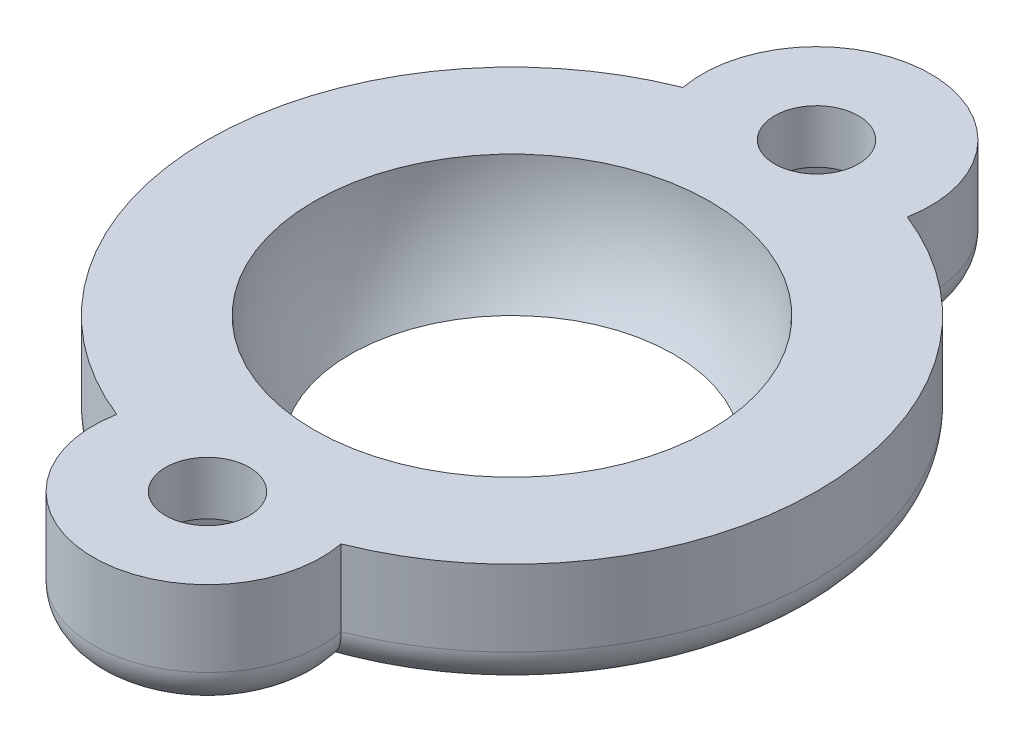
ISO-10303-21;
HEADER;
FILE_DESCRIPTION(('STEP AP214'),'2;1');
FILE_NAME('part.step','',(''),(''),'','','');
FILE_SCHEMA(('AUTOMOTIVE_DESIGN { 1 0 10303 214 1 1 1 1 }'));
ENDSEC;
DATA;
#1=APPLICATION_CONTEXT('core data for automotive mechanical design processes');
#2=APPLICATION_PROTOCOL_DEFINITION('international standard','automotive_design',2000,#1);
#3=PRODUCT_CONTEXT('',#1,'mechanical');
#4=PRODUCT('Part','Part','',(#3));
#5=PRODUCT_RELATED_PRODUCT_CATEGORY('part','',(#4));
#6=PRODUCT_DEFINITION_FORMATION('','',#4);
#7=PRODUCT_DEFINITION_CONTEXT('part definition',#1,'design');
#8=PRODUCT_DEFINITION('design','',#6,#7);
#9=PRODUCT_DEFINITION_SHAPE('','',#8);
#10=(LENGTH_UNIT() NAMED_UNIT(*) SI_UNIT(.MILLI.,.METRE.));
#11=(NAMED_UNIT(*) PLANE_ANGLE_UNIT() SI_UNIT($,.RADIAN.));
#12=(NAMED_UNIT(*) SI_UNIT($,.STERADIAN.) SOLID_ANGLE_UNIT());
#13=UNCERTAINTY_MEASURE_WITH_UNIT(LENGTH_MEASURE(1.E-05),#10,'distance_accuracy_value','');
#14=(GEOMETRIC_REPRESENTATION_CONTEXT(3) GLOBAL_UNCERTAINTY_ASSIGNED_CONTEXT((#13)) GLOBAL_UNIT_ASSIGNED_CONTEXT((#10,
#11,#12)) REPRESENTATION_CONTEXT('',''));
#15=CARTESIAN_POINT('',(0.,0.,0.));
#16=DIRECTION('',(0.,0.,1.));
#17=DIRECTION('',(1.,0.,0.));
#18=AXIS2_PLACEMENT_3D('',#15,#16,#17);
#19=CARTESIAN_POINT('',(-73.1998646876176,-6.5,-38.5));
#20=DIRECTION('',(0.,-1.,0.));
#21=DIRECTION('',(0.,0.,-1.));
#22=AXIS2_PLACEMENT_3D('',#19,#20,#21);
#23=PLANE('',#22);
#24=DIRECTION('',(0.500000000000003,0.,-0.866025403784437));
#25=VECTOR('',#24,1.);
#26=CARTESIAN_POINT('',(-75.3937957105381,-6.5,-42.5));
#27=LINE('',#26,#25);
#28=CARTESIAN_POINT('',(-75.1575628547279,-6.5,-42.9091673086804));
#29=VERTEX_POINT('',#28);
#30=CARTESIAN_POINT('',(-74.533063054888,-6.5,-43.9908326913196));
#31=VERTEX_POINT('',#30);
#32=EDGE_CURVE('E432',#29,#31,#27,.T.);
#33=ORIENTED_EDGE('',*,*,#32,.F.);
#34=CARTESIAN_POINT('',(-73.1998646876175,-6.5,-42.5));
#35=DIRECTION('',(0.,-1.,0.));
#36=DIRECTION('',(0.,0.,-1.));
#37=AXIS2_PLACEMENT_3D('',#34,#35,#36);
#38=CIRCLE('',#37,2.00000000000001);
#39=EDGE_CURVE('E287',#29,#31,#38,.T.);
#40=ORIENTED_EDGE('',*,*,#39,.T.);
#41=EDGE_LOOP('',(#33,#40));
#42=FACE_BOUND('',#41,.T.);
#43=ADVANCED_FACE('F37',(#42),#23,.T.);
#44=DIRECTION('',(1.,0.,0.));
#45=VECTOR('',#44,1.);
#46=CARTESIAN_POINT('',(-74.2968301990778,-6.5,-44.4));
#47=LINE('',#46,#45);
#48=CARTESIAN_POINT('',(-73.8243644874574,-6.5,-44.4));
#49=VERTEX_POINT('',#48);
#50=CARTESIAN_POINT('',(-72.5753648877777,-6.5,-44.4));
#51=VERTEX_POINT('',#50);
#52=EDGE_CURVE('E436',#49,#51,#47,.T.);
#53=ORIENTED_EDGE('',*,*,#52,.F.);
#54=CARTESIAN_POINT('',(-73.1998646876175,-6.5,-42.5));
#55=DIRECTION('',(0.,-1.,0.));
#56=DIRECTION('',(0.,0.,-1.));
#57=AXIS2_PLACEMENT_3D('',#54,#55,#56);
#58=CIRCLE('',#57,2.00000000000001);
#59=EDGE_CURVE('E285',#49,#51,#58,.T.);
#60=ORIENTED_EDGE('',*,*,#59,.T.);
#61=EDGE_LOOP('',(#53,#60));
#62=FACE_BOUND('',#61,.T.);
#63=ADVANCED_FACE('F423',(#62),#23,.T.);
#64=DIRECTION('',(0.5,0.,0.866025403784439));
#65=VECTOR('',#64,1.);
#66=CARTESIAN_POINT('',(-72.1028991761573,-6.5,-44.4));
#67=LINE('',#66,#65);
#68=CARTESIAN_POINT('',(-71.8666663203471,-6.5,-43.9908326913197));
#69=VERTEX_POINT('',#68);
#70=CARTESIAN_POINT('',(-71.2421665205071,-6.5,-42.9091673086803));
#71=VERTEX_POINT('',#70);
#72=EDGE_CURVE('E496',#69,#71,#67,.T.);
#73=ORIENTED_EDGE('',*,*,#72,.F.);
#74=CARTESIAN_POINT('',(-73.1998646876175,-6.5,-42.5));
#75=DIRECTION('',(0.,-1.,0.));
#76=DIRECTION('',(0.,0.,-1.));
#77=AXIS2_PLACEMENT_3D('',#74,#75,#76);
#78=CIRCLE('',#77,2.00000000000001);
#79=EDGE_CURVE('E283',#69,#71,#78,.T.);
#80=ORIENTED_EDGE('',*,*,#79,.T.);
#81=EDGE_LOOP('',(#73,#80));
#82=FACE_BOUND('',#81,.T.);
#83=ADVANCED_FACE('F428',(#82),#23,.T.);
#84=CARTESIAN_POINT('',(-73.1998646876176,-6.5,-34.5));
#85=DIRECTION('',(0.,-1.,0.));
#86=DIRECTION('',(0.,0.,-1.));
#87=AXIS2_PLACEMENT_3D('',#84,#85,#86);
#88=CIRCLE('',#87,4.24735211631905);
#89=CARTESIAN_POINT('',(-73.1998646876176,-6.5,-38.7473521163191));
#90=VERTEX_POINT('',#89);
#91=EDGE_CURVE('E252',#90,#90,#88,.F.);
#92=ORIENTED_EDGE('',*,*,#91,.T.);
#93=EDGE_LOOP('',(#92));
#94=FACE_BOUND('',#93,.T.);
#95=DIRECTION('',(-0.500000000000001,0.,0.866025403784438));
#96=VECTOR('',#95,1.);
#97=CARTESIAN_POINT('',(-71.005933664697,-6.5,-42.5));
#98=LINE('',#97,#96);
#99=CARTESIAN_POINT('',(-71.2421665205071,-6.5,-42.0908326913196));
#100=VERTEX_POINT('',#99);
#101=CARTESIAN_POINT('',(-72.1028991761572,-6.5,-40.6));
#102=VERTEX_POINT('',#101);
#103=EDGE_CURVE('E489',#100,#102,#98,.T.);
#104=ORIENTED_EDGE('',*,*,#103,.F.);
#105=CARTESIAN_POINT('',(-73.1998646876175,-6.5,-42.5));
#106=DIRECTION('',(0.,-1.,0.));
#107=DIRECTION('',(0.,0.,-1.));
#108=AXIS2_PLACEMENT_3D('',#105,#106,#107);
#109=CIRCLE('',#108,2.00000000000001);
#110=CARTESIAN_POINT('',(-71.5905655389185,-6.5,-41.3124999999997));
#111=VERTEX_POINT('',#110);
#112=EDGE_CURVE('E281',#100,#111,#109,.T.);
#113=ORIENTED_EDGE('',*,*,#112,.T.);
#114=CARTESIAN_POINT('',(-73.1998646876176,-6.5,-34.5));
#115=DIRECTION('',(0.,-1.,0.));
#116=DIRECTION('',(0.,0.,-1.));
#117=AXIS2_PLACEMENT_3D('',#114,#115,#116);
#118=CIRCLE('',#117,7.00000000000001);
#119=CARTESIAN_POINT('',(-71.5905655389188,-6.5,-27.687499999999));
#120=VERTEX_POINT('',#119);
#121=EDGE_CURVE('E279',#111,#120,#118,.T.);
#122=ORIENTED_EDGE('',*,*,#121,.T.);
#123=CARTESIAN_POINT('',(-73.1998646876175,-6.5,-26.5));
#124=DIRECTION('',(0.,-1.,0.));
#125=DIRECTION('',(0.,0.,-1.));
#126=AXIS2_PLACEMENT_3D('',#123,#124,#125);
#127=CIRCLE('',#126,2.00000000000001);
#128=CARTESIAN_POINT('',(-71.2421665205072,-6.5,-26.9091673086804));
#129=VERTEX_POINT('',#128);
#130=EDGE_CURVE('E277',#120,#129,#127,.T.);
#131=ORIENTED_EDGE('',*,*,#130,.T.);
#132=DIRECTION('',(0.499999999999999,0.,0.866025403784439));
#133=VECTOR('',#132,1.);
#134=CARTESIAN_POINT('',(-72.1028991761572,-6.5,-28.4));
#135=LINE('',#134,#133);
#136=CARTESIAN_POINT('',(-72.1028991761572,-6.5,-28.4));
#137=VERTEX_POINT('',#136);
#138=EDGE_CURVE('E263',#137,#129,#135,.T.);
#139=ORIENTED_EDGE('',*,*,#138,.F.);
#140=DIRECTION('',(1.,0.,0.));
#141=VECTOR('',#140,1.);
#142=CARTESIAN_POINT('',(-74.2968301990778,-6.5,-28.4));
#143=LINE('',#142,#141);
#144=CARTESIAN_POINT('',(-74.2968301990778,-6.5,-28.4));
#145=VERTEX_POINT('',#144);
#146=EDGE_CURVE('E602',#145,#137,#143,.T.);
#147=ORIENTED_EDGE('',*,*,#146,.F.);
#148=DIRECTION('',(0.499999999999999,0.,-0.866025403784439));
#149=VECTOR('',#148,1.);
#150=CARTESIAN_POINT('',(-75.3937957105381,-6.5,-26.5));
#151=LINE('',#150,#149);
#152=CARTESIAN_POINT('',(-75.1575628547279,-6.5,-26.9091673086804));
#153=VERTEX_POINT('',#152);
#154=EDGE_CURVE('E543',#153,#145,#151,.T.);
#155=ORIENTED_EDGE('',*,*,#154,.F.);
#156=CARTESIAN_POINT('',(-73.1998646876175,-6.5,-26.5));
#157=DIRECTION('',(0.,-1.,0.));
#158=DIRECTION('',(0.,0.,-1.));
#159=AXIS2_PLACEMENT_3D('',#156,#157,#158);
#160=CIRCLE('',#159,2.00000000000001);
#161=CARTESIAN_POINT('',(-74.8091638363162,-6.5,-27.687499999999));
#162=VERTEX_POINT('',#161);
#163=EDGE_CURVE('E244',#153,#162,#160,.T.);
#164=ORIENTED_EDGE('',*,*,#163,.T.);
#165=CARTESIAN_POINT('',(-73.1998646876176,-6.5,-34.5));
#166=DIRECTION('',(0.,-1.,0.));
#167=DIRECTION('',(0.,0.,-1.));
#168=AXIS2_PLACEMENT_3D('',#165,#166,#167);
#169=CIRCLE('',#168,7.00000000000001);
#170=CARTESIAN_POINT('',(-74.8091638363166,-6.5,-41.3124999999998));
#171=VERTEX_POINT('',#170);
#172=EDGE_CURVE('E246',#162,#171,#169,.T.);
#173=ORIENTED_EDGE('',*,*,#172,.T.);
#174=CARTESIAN_POINT('',(-73.1998646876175,-6.5,-42.5));
#175=DIRECTION('',(0.,-1.,0.));
#176=DIRECTION('',(0.,0.,-1.));
#177=AXIS2_PLACEMENT_3D('',#174,#175,#176);
#178=CIRCLE('',#177,2.00000000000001);
#179=CARTESIAN_POINT('',(-75.1575628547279,-6.5,-42.0908326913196));
#180=VERTEX_POINT('',#179);
#181=EDGE_CURVE('E268',#171,#180,#178,.T.);
#182=ORIENTED_EDGE('',*,*,#181,.T.);
#183=DIRECTION('',(-0.499999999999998,0.,-0.86602540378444));
#184=VECTOR('',#183,1.);
#185=CARTESIAN_POINT('',(-74.2968301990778,-6.5,-40.6));
#186=LINE('',#185,#184);
#187=CARTESIAN_POINT('',(-74.2968301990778,-6.5,-40.6));
#188=VERTEX_POINT('',#187);
#189=EDGE_CURVE('E437',#188,#180,#186,.T.);
#190=ORIENTED_EDGE('',*,*,#189,.F.);
#191=DIRECTION('',(-1.,0.,0.));
#192=VECTOR('',#191,1.);
#193=CARTESIAN_POINT('',(-72.1028991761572,-6.5,-40.6));
#194=LINE('',#193,#192);
#195=EDGE_CURVE('E494',#102,#188,#194,.T.);
#196=ORIENTED_EDGE('',*,*,#195,.F.);
#197=EDGE_LOOP('',(#104,#113,#122,#131,#139,#147,#155,#164,#173,#182,#190,#196));
#198=FACE_BOUND('',#197,.T.);
#199=ADVANCED_FACE('F483',(#94,#198),#23,.T.);
#200=DIRECTION('',(-0.500000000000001,0.,0.866025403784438));
#201=VECTOR('',#200,1.);
#202=CARTESIAN_POINT('',(-71.0059336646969,-6.5,-26.5));
#203=LINE('',#202,#201);
#204=CARTESIAN_POINT('',(-71.2421665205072,-6.5,-26.0908326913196));
#205=VERTEX_POINT('',#204);
#206=CARTESIAN_POINT('',(-71.8666663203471,-6.5,-25.0091673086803));
#207=VERTEX_POINT('',#206);
#208=EDGE_CURVE('E586',#205,#207,#203,.T.);
#209=ORIENTED_EDGE('',*,*,#208,.F.);
#210=CARTESIAN_POINT('',(-73.1998646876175,-6.5,-26.5));
#211=DIRECTION('',(0.,-1.,0.));
#212=DIRECTION('',(0.,0.,-1.));
#213=AXIS2_PLACEMENT_3D('',#210,#211,#212);
#214=CIRCLE('',#213,2.00000000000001);
#215=EDGE_CURVE('E275',#205,#207,#214,.T.);
#216=ORIENTED_EDGE('',*,*,#215,.T.);
#217=EDGE_LOOP('',(#209,#216));
#218=FACE_BOUND('',#217,.T.);
#219=ADVANCED_FACE('F486',(#218),#23,.T.);
#220=DIRECTION('',(-1.,0.,0.));
#221=VECTOR('',#220,1.);
#222=CARTESIAN_POINT('',(-72.1028991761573,-6.5,-24.6));
#223=LINE('',#222,#221);
#224=CARTESIAN_POINT('',(-72.5753648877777,-6.5,-24.6));
#225=VERTEX_POINT('',#224);
#226=CARTESIAN_POINT('',(-73.8243644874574,-6.5,-24.6));
#227=VERTEX_POINT('',#226);
#228=EDGE_CURVE('E594',#225,#227,#223,.T.);
#229=ORIENTED_EDGE('',*,*,#228,.F.);
#230=CARTESIAN_POINT('',(-73.1998646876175,-6.5,-26.5));
#231=DIRECTION('',(0.,-1.,0.));
#232=DIRECTION('',(0.,0.,-1.));
#233=AXIS2_PLACEMENT_3D('',#230,#231,#232);
#234=CIRCLE('',#233,2.00000000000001);
#235=EDGE_CURVE('E273',#225,#227,#234,.T.);
#236=ORIENTED_EDGE('',*,*,#235,.T.);
#237=EDGE_LOOP('',(#229,#236));
#238=FACE_BOUND('',#237,.T.);
#239=ADVANCED_FACE('F373',(#238),#23,.T.);
#240=CARTESIAN_POINT('',(-73.1998646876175,5.,-42.5));
#241=DIRECTION('',(0.,-1.,0.));
#242=DIRECTION('',(0.,0.,-1.));
#243=AXIS2_PLACEMENT_3D('',#240,#241,#242);
#244=CYLINDRICAL_SURFACE('',#243,1.1);
#245=CARTESIAN_POINT('',(-73.1998646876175,-3.5,-42.5));
#246=DIRECTION('',(0.,-1.,0.));
#247=DIRECTION('',(0.,0.,-1.));
#248=AXIS2_PLACEMENT_3D('',#245,#246,#247);
#249=CIRCLE('',#248,1.1);
#250=CARTESIAN_POINT('',(-73.1998646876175,-3.5,-43.6));
#251=VERTEX_POINT('',#250);
#252=EDGE_CURVE('E475',#251,#251,#249,.T.);
#253=ORIENTED_EDGE('',*,*,#252,.F.);
#254=EDGE_LOOP('',(#253));
#255=FACE_BOUND('',#254,.T.);
#256=CARTESIAN_POINT('',(-73.1998646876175,-4.9,-42.5));
#257=DIRECTION('',(0.,-1.,0.));
#258=DIRECTION('',(0.,0.,-1.));
#259=AXIS2_PLACEMENT_3D('',#256,#257,#258);
#260=CIRCLE('',#259,1.1);
#261=CARTESIAN_POINT('',(-73.1998646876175,-4.9,-43.6));
#262=VERTEX_POINT('',#261);
#263=EDGE_CURVE('E260',#262,#262,#260,.T.);
#264=ORIENTED_EDGE('',*,*,#263,.T.);
#265=EDGE_LOOP('',(#264));
#266=FACE_BOUND('',#265,.T.);
#267=ADVANCED_FACE('F374',(#255,#266),#244,.F.);
#268=CARTESIAN_POINT('',(-73.1998646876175,5.,-26.5));
#269=DIRECTION('',(0.,-1.,0.));
#270=DIRECTION('',(0.,0.,-1.));
#271=AXIS2_PLACEMENT_3D('',#268,#269,#270);
#272=CYLINDRICAL_SURFACE('',#271,1.10000000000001);
#273=CARTESIAN_POINT('',(-73.1998646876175,-3.5,-26.5));
#274=DIRECTION('',(0.,-1.,0.));
#275=DIRECTION('',(0.,0.,-1.));
#276=AXIS2_PLACEMENT_3D('',#273,#274,#275);
#277=CIRCLE('',#276,1.10000000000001);
#278=CARTESIAN_POINT('',(-73.1998646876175,-3.5,-27.6));
#279=VERTEX_POINT('',#278);
#280=EDGE_CURVE('E228',#279,#279,#277,.T.);
#281=ORIENTED_EDGE('',*,*,#280,.F.);
#282=EDGE_LOOP('',(#281));
#283=FACE_BOUND('',#282,.T.);
#284=CARTESIAN_POINT('',(-73.1998646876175,-4.9,-26.5));
#285=DIRECTION('',(0.,-1.,0.));
#286=DIRECTION('',(0.,0.,-1.));
#287=AXIS2_PLACEMENT_3D('',#284,#285,#286);
#288=CIRCLE('',#287,1.10000000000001);
#289=CARTESIAN_POINT('',(-73.1998646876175,-4.9,-27.6));
#290=VERTEX_POINT('',#289);
#291=EDGE_CURVE('E256',#290,#290,#288,.T.);
#292=ORIENTED_EDGE('',*,*,#291,.T.);
#293=EDGE_LOOP('',(#292));
#294=FACE_BOUND('',#293,.T.);
#295=ADVANCED_FACE('F371',(#283,#294),#272,.F.);
#296=DIRECTION('',(-0.500000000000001,0.,-0.866025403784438));
#297=VECTOR('',#296,1.);
#298=CARTESIAN_POINT('',(-74.2968301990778,-6.5,-24.6));
#299=LINE('',#298,#297);
#300=CARTESIAN_POINT('',(-74.533063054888,-6.5,-25.0091673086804));
#301=VERTEX_POINT('',#300);
#302=CARTESIAN_POINT('',(-75.1575628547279,-6.5,-26.0908326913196));
#303=VERTEX_POINT('',#302);
#304=EDGE_CURVE('E595',#301,#303,#299,.T.);
#305=ORIENTED_EDGE('',*,*,#304,.F.);
#306=CARTESIAN_POINT('',(-73.1998646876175,-6.5,-26.5));
#307=DIRECTION('',(0.,-1.,0.));
#308=DIRECTION('',(0.,0.,-1.));
#309=AXIS2_PLACEMENT_3D('',#306,#307,#308);
#310=CIRCLE('',#309,2.00000000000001);
#311=EDGE_CURVE('E271',#301,#303,#310,.T.);
#312=ORIENTED_EDGE('',*,*,#311,.T.);
#313=EDGE_LOOP('',(#305,#312));
#314=FACE_BOUND('',#313,.T.);
#315=ADVANCED_FACE('F368',(#314),#23,.T.);
#316=CARTESIAN_POINT('',(-73.1998646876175,5.,-42.5));
#317=DIRECTION('',(0.,-1.,0.));
#318=DIRECTION('',(0.,0.,-1.));
#319=AXIS2_PLACEMENT_3D('',#316,#317,#318);
#320=CYLINDRICAL_SURFACE('',#319,3.00000000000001);
#321=DIRECTION('',(0.,-1.,0.));
#322=VECTOR('',#321,1.);
#323=CARTESIAN_POINT('',(-70.2530708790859,5.,-41.9375));
#324=LINE('',#323,#322);
#325=CARTESIAN_POINT('',(-70.253070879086,-3.5,-41.9375));
#326=VERTEX_POINT('',#325);
#327=CARTESIAN_POINT('',(-70.2530708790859,-5.5,-41.9375));
#328=VERTEX_POINT('',#327);
#329=EDGE_CURVE('E222',#326,#328,#324,.T.);
#330=ORIENTED_EDGE('',*,*,#329,.T.);
#331=CARTESIAN_POINT('',(-73.1998646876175,-5.5,-42.5));
#332=DIRECTION('',(0.,-1.,0.));
#333=DIRECTION('',(0.,0.,-1.));
#334=AXIS2_PLACEMENT_3D('',#331,#332,#333);
#335=CIRCLE('',#334,3.00000000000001);
#336=CARTESIAN_POINT('',(-76.1466584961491,-5.5,-41.9375));
#337=VERTEX_POINT('',#336);
#338=EDGE_CURVE('E333',#328,#337,#335,.F.);
#339=ORIENTED_EDGE('',*,*,#338,.T.);
#340=DIRECTION('',(0.,-1.,0.));
#341=VECTOR('',#340,1.);
#342=CARTESIAN_POINT('',(-76.1466584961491,5.,-41.9375));
#343=LINE('',#342,#341);
#344=CARTESIAN_POINT('',(-76.1466584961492,-3.5,-41.9375));
#345=VERTEX_POINT('',#344);
#346=EDGE_CURVE('E225',#345,#337,#343,.T.);
#347=ORIENTED_EDGE('',*,*,#346,.F.);
#348=CARTESIAN_POINT('',(-73.1998646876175,-3.5,-42.5));
#349=DIRECTION('',(0.,-1.,0.));
#350=DIRECTION('',(0.,0.,-1.));
#351=AXIS2_PLACEMENT_3D('',#348,#349,#350);
#352=CIRCLE('',#351,3.00000000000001);
#353=EDGE_CURVE('E217',#345,#326,#352,.T.);
#354=ORIENTED_EDGE('',*,*,#353,.T.);
#355=EDGE_LOOP('',(#330,#339,#347,#354));
#356=FACE_BOUND('',#355,.T.);
#357=ADVANCED_FACE('F219',(#356),#320,.T.);
#358=CARTESIAN_POINT('',(-73.1998646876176,5.,-34.5));
#359=DIRECTION('',(0.,-1.,0.));
#360=DIRECTION('',(0.,0.,-1.));
#361=AXIS2_PLACEMENT_3D('',#358,#359,#360);
#362=CYLINDRICAL_SURFACE('',#361,8.00000000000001);
#363=ORIENTED_EDGE('',*,*,#346,.T.);
#364=CARTESIAN_POINT('',(-73.1998646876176,-5.5,-34.5));
#365=DIRECTION('',(0.,-1.,0.));
#366=DIRECTION('',(0.,0.,-1.));
#367=AXIS2_PLACEMENT_3D('',#364,#365,#366);
#368=CIRCLE('',#367,8.00000000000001);
#369=CARTESIAN_POINT('',(-76.1466584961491,-5.5,-27.0625));
#370=VERTEX_POINT('',#369);
#371=EDGE_CURVE('E341',#337,#370,#368,.F.);
#372=ORIENTED_EDGE('',*,*,#371,.T.);
#373=DIRECTION('',(0.,-1.,0.));
#374=VECTOR('',#373,1.);
#375=CARTESIAN_POINT('',(-76.1466584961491,5.,-27.0625));
#376=LINE('',#375,#374);
#377=CARTESIAN_POINT('',(-76.1466584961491,-3.5,-27.0625));
#378=VERTEX_POINT('',#377);
#379=EDGE_CURVE('E248',#378,#370,#376,.T.);
#380=ORIENTED_EDGE('',*,*,#379,.F.);
#381=CARTESIAN_POINT('',(-73.1998646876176,-3.5,-34.5));
#382=DIRECTION('',(0.,-1.,0.));
#383=DIRECTION('',(0.,0.,-1.));
#384=AXIS2_PLACEMENT_3D('',#381,#382,#383);
#385=CIRCLE('',#384,8.00000000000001);
#386=EDGE_CURVE('E229',#378,#345,#385,.T.);
#387=ORIENTED_EDGE('',*,*,#386,.T.);
#388=EDGE_LOOP('',(#363,#372,#380,#387));
#389=FACE_BOUND('',#388,.T.);
#390=ADVANCED_FACE('F386',(#389),#362,.T.);
#391=CARTESIAN_POINT('',(-73.1998646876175,5.,-26.5));
#392=DIRECTION('',(0.,-1.,0.));
#393=DIRECTION('',(0.,0.,-1.));
#394=AXIS2_PLACEMENT_3D('',#391,#392,#393);
#395=CYLINDRICAL_SURFACE('',#394,3.00000000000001);
#396=ORIENTED_EDGE('',*,*,#379,.T.);
#397=CARTESIAN_POINT('',(-73.1998646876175,-5.5,-26.5));
#398=DIRECTION('',(0.,-1.,0.));
#399=DIRECTION('',(0.,0.,-1.));
#400=AXIS2_PLACEMENT_3D('',#397,#398,#399);
#401=CIRCLE('',#400,3.00000000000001);
#402=CARTESIAN_POINT('',(-70.2530708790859,-5.5,-27.0625));
#403=VERTEX_POINT('',#402);
#404=EDGE_CURVE('E11',#370,#403,#401,.F.);
#405=ORIENTED_EDGE('',*,*,#404,.T.);
#406=DIRECTION('',(0.,-1.,0.));
#407=VECTOR('',#406,1.);
#408=CARTESIAN_POINT('',(-70.2530708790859,5.,-27.0625));
#409=LINE('',#408,#407);
#410=CARTESIAN_POINT('',(-70.2530708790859,-3.5,-27.0625));
#411=VERTEX_POINT('',#410);
#412=EDGE_CURVE('E255',#411,#403,#409,.T.);
#413=ORIENTED_EDGE('',*,*,#412,.F.);
#414=CARTESIAN_POINT('',(-73.1998646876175,-3.5,-26.5));
#415=DIRECTION('',(0.,-1.,0.));
#416=DIRECTION('',(0.,0.,-1.));
#417=AXIS2_PLACEMENT_3D('',#414,#415,#416);
#418=CIRCLE('',#417,3.00000000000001);
#419=EDGE_CURVE('E235',#411,#378,#418,.T.);
#420=ORIENTED_EDGE('',*,*,#419,.T.);
#421=EDGE_LOOP('',(#396,#405,#413,#420));
#422=FACE_BOUND('',#421,.T.);
#423=ADVANCED_FACE('F383',(#422),#395,.T.);
#424=CARTESIAN_POINT('',(-73.1998646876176,5.,-34.5));
#425=DIRECTION('',(0.,-1.,0.));
#426=DIRECTION('',(0.,0.,-1.));
#427=AXIS2_PLACEMENT_3D('',#424,#425,#426);
#428=CYLINDRICAL_SURFACE('',#427,8.00000000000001);
#429=ORIENTED_EDGE('',*,*,#412,.T.);
#430=CARTESIAN_POINT('',(-73.1998646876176,-5.5,-34.5));
#431=DIRECTION('',(0.,-1.,0.));
#432=DIRECTION('',(0.,0.,-1.));
#433=AXIS2_PLACEMENT_3D('',#430,#431,#432);
#434=CIRCLE('',#433,8.00000000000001);
#435=EDGE_CURVE('E243',#403,#328,#434,.F.);
#436=ORIENTED_EDGE('',*,*,#435,.T.);
#437=ORIENTED_EDGE('',*,*,#329,.F.);
#438=CARTESIAN_POINT('',(-73.1998646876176,-3.5,-34.5));
#439=DIRECTION('',(0.,-1.,0.));
#440=DIRECTION('',(0.,0.,-1.));
#441=AXIS2_PLACEMENT_3D('',#438,#439,#440);
#442=CIRCLE('',#441,8.00000000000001);
#443=EDGE_CURVE('E232',#326,#411,#442,.T.);
#444=ORIENTED_EDGE('',*,*,#443,.T.);
#445=EDGE_LOOP('',(#429,#436,#437,#444));
#446=FACE_BOUND('',#445,.T.);
#447=ADVANCED_FACE('F241',(#446),#428,.T.);
#448=CARTESIAN_POINT('',(-73.1998646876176,-3.5,-34.5));
#449=DIRECTION('',(0.,1.,0.));
#450=DIRECTION('',(1.,0.,0.));
#451=AXIS2_PLACEMENT_3D('',#448,#449,#450);
#452=SPHERICAL_SURFACE('',#451,5.19999999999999);
#453=CARTESIAN_POINT('',(-73.1998646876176,-3.5,-34.5));
#454=DIRECTION('',(0.,-1.,0.));
#455=DIRECTION('',(0.,0.,-1.));
#456=AXIS2_PLACEMENT_3D('',#453,#454,#455);
#457=CIRCLE('',#456,5.19999999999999);
#458=CARTESIAN_POINT('',(-73.1998646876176,-3.5,-39.7));
#459=VERTEX_POINT('',#458);
#460=EDGE_CURVE('E239',#459,#459,#457,.T.);
#461=ORIENTED_EDGE('',*,*,#460,.F.);
#462=EDGE_LOOP('',(#461));
#463=FACE_BOUND('',#462,.T.);
#464=ORIENTED_EDGE('',*,*,#91,.F.);
#465=EDGE_LOOP('',(#464));
#466=FACE_BOUND('',#465,.T.);
#467=ADVANCED_FACE('F360',(#463,#466),#452,.F.);
#468=CARTESIAN_POINT('',(-72.1028991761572,-4.9,-28.4));
#469=DIRECTION('',(0.866025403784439,0.,-0.499999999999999));
#470=DIRECTION('',(-0.499999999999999,0.,-0.866025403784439));
#471=AXIS2_PLACEMENT_3D('',#468,#469,#470);
#472=PLANE('',#471);
#473=ORIENTED_EDGE('',*,*,#138,.T.);
#474=CARTESIAN_POINT('',(-71.2421665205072,-6.5,-26.9091673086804));
#475=CARTESIAN_POINT('',(-71.2224549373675,-6.49999684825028,-26.8750258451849));
#476=CARTESIAN_POINT('',(-71.2027412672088,-6.49977279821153,-26.8408807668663));
#477=CARTESIAN_POINT('',(-71.1633313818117,-6.49862474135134,-26.7726208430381));
#478=CARTESIAN_POINT('',(-71.1436351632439,-6.49770115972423,-26.7385059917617));
#479=CARTESIAN_POINT('',(-71.1042519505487,-6.49489608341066,-26.6702922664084));
#480=CARTESIAN_POINT('',(-71.0845649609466,-6.49301430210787,-26.6361934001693));
#481=CARTESIAN_POINT('',(-71.0452190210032,-6.48801322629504,-26.5680442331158));
#482=CARTESIAN_POINT('',(-71.0255600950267,-6.48489317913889,-26.5339939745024));
#483=CARTESIAN_POINT('',(-71.0059336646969,-6.48101516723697,-26.5));
#484=B_SPLINE_CURVE_WITH_KNOTS('',3,(#474,#475,#476,#477,#478,#479,#480,#481,#482,#483),
.UNSPECIFIED.,.F.,.F.,(4,2,2,2,4),(0.,0.118275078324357,0.236478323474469,0.35471694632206,
0.473027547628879),.UNSPECIFIED.);
#485=CARTESIAN_POINT('',(-71.0059336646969,-6.48101516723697,-26.5));
#486=VERTEX_POINT('',#485);
#487=EDGE_CURVE('E343',#129,#486,#484,.T.);
#488=ORIENTED_EDGE('',*,*,#487,.T.);
#489=DIRECTION('',(0.,-1.,0.));
#490=VECTOR('',#489,1.);
#491=CARTESIAN_POINT('',(-71.0059336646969,-4.9,-26.5));
#492=LINE('',#491,#490);
#493=CARTESIAN_POINT('',(-71.0059336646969,-4.9,-26.5));
#494=VERTEX_POINT('',#493);
#495=EDGE_CURVE('E513',#494,#486,#492,.T.);
#496=ORIENTED_EDGE('',*,*,#495,.F.);
#497=DIRECTION('',(0.499999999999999,0.,0.866025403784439));
#498=VECTOR('',#497,1.);
#499=CARTESIAN_POINT('',(-72.1028991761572,-4.9,-28.4));
#500=LINE('',#499,#498);
#501=CARTESIAN_POINT('',(-72.1028991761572,-4.9,-28.4));
#502=VERTEX_POINT('',#501);
#503=EDGE_CURVE('E605',#502,#494,#500,.T.);
#504=ORIENTED_EDGE('',*,*,#503,.F.);
#505=DIRECTION('',(0.,-1.,0.));
#506=VECTOR('',#505,1.);
#507=CARTESIAN_POINT('',(-72.1028991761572,-4.9,-28.4));
#508=LINE('',#507,#506);
#509=EDGE_CURVE('E259',#502,#137,#508,.T.);
#510=ORIENTED_EDGE('',*,*,#509,.T.);
#511=EDGE_LOOP('',(#473,#488,#496,#504,#510));
#512=FACE_BOUND('',#511,.T.);
#513=ADVANCED_FACE('F355',(#512),#472,.F.);
#514=CARTESIAN_POINT('',(-74.2968301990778,-4.9,-28.4));
#515=DIRECTION('',(0.,0.,-1.));
#516=DIRECTION('',(-1.,0.,0.));
#517=AXIS2_PLACEMENT_3D('',#514,#515,#516);
#518=PLANE('',#517);
#519=ORIENTED_EDGE('',*,*,#146,.T.);
#520=ORIENTED_EDGE('',*,*,#509,.F.);
#521=DIRECTION('',(1.,0.,0.));
#522=VECTOR('',#521,1.);
#523=CARTESIAN_POINT('',(-74.2968301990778,-4.9,-28.4));
#524=LINE('',#523,#522);
#525=CARTESIAN_POINT('',(-74.2968301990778,-4.9,-28.4));
#526=VERTEX_POINT('',#525);
#527=EDGE_CURVE('E522',#526,#502,#524,.T.);
#528=ORIENTED_EDGE('',*,*,#527,.F.);
#529=DIRECTION('',(0.,-1.,0.));
#530=VECTOR('',#529,1.);
#531=CARTESIAN_POINT('',(-74.2968301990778,-4.9,-28.4));
#532=LINE('',#531,#530);
#533=EDGE_CURVE('E607',#526,#145,#532,.T.);
#534=ORIENTED_EDGE('',*,*,#533,.T.);
#535=EDGE_LOOP('',(#519,#520,#528,#534));
#536=FACE_BOUND('',#535,.T.);
#537=ADVANCED_FACE('F359',(#536),#518,.F.);
#538=CARTESIAN_POINT('',(-75.3937957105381,-4.9,-26.5));
#539=DIRECTION('',(-0.86602540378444,0.,-0.499999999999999));
#540=DIRECTION('',(-0.499999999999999,0.,0.86602540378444));
#541=AXIS2_PLACEMENT_3D('',#538,#539,#540);
#542=PLANE('',#541);
#543=DIRECTION('',(0.,-1.,0.));
#544=VECTOR('',#543,1.);
#545=CARTESIAN_POINT('',(-75.3937957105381,-4.9,-26.5));
#546=LINE('',#545,#544);
#547=CARTESIAN_POINT('',(-75.3937957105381,-4.9,-26.5));
#548=VERTEX_POINT('',#547);
#549=CARTESIAN_POINT('',(-75.3937957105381,-6.48101516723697,-26.5));
#550=VERTEX_POINT('',#549);
#551=EDGE_CURVE('E610',#548,#550,#546,.T.);
#552=ORIENTED_EDGE('',*,*,#551,.T.);
#553=CARTESIAN_POINT('',(-75.3937957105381,-6.48101516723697,-26.5));
#554=CARTESIAN_POINT('',(-75.3741692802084,-6.48489317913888,-26.5339939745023));
#555=CARTESIAN_POINT('',(-75.3545103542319,-6.48801322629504,-26.5680442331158));
#556=CARTESIAN_POINT('',(-75.3151644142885,-6.49301430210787,-26.6361934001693));
#557=CARTESIAN_POINT('',(-75.2954774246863,-6.49489608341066,-26.6702922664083));
#558=CARTESIAN_POINT('',(-75.2560942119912,-6.49770115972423,-26.7385059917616));
#559=CARTESIAN_POINT('',(-75.2363979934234,-6.49862474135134,-26.7726208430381));
#560=CARTESIAN_POINT('',(-75.1969881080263,-6.49977279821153,-26.8408807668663));
#561=CARTESIAN_POINT('',(-75.1772744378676,-6.49999684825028,-26.8750258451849));
#562=CARTESIAN_POINT('',(-75.1575628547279,-6.5,-26.9091673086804));
#563=B_SPLINE_CURVE_WITH_KNOTS('',3,(#553,#554,#555,#556,#557,#558,#559,#560,#561,#562),
.UNSPECIFIED.,.F.,.F.,(4,2,2,2,4),(0.,0.118310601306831,0.236549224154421,0.354752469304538,
0.473027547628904),.UNSPECIFIED.);
#564=EDGE_CURVE('E50',#550,#153,#563,.T.);
#565=ORIENTED_EDGE('',*,*,#564,.T.);
#566=ORIENTED_EDGE('',*,*,#154,.T.);
#567=ORIENTED_EDGE('',*,*,#533,.F.);
#568=DIRECTION('',(0.499999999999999,0.,-0.866025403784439));
#569=VECTOR('',#568,1.);
#570=CARTESIAN_POINT('',(-75.3937957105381,-4.9,-26.5));
#571=LINE('',#570,#569);
#572=EDGE_CURVE('E528',#548,#526,#571,.T.);
#573=ORIENTED_EDGE('',*,*,#572,.F.);
#574=EDGE_LOOP('',(#552,#565,#566,#567,#573));
#575=FACE_BOUND('',#574,.T.);
#576=ADVANCED_FACE('F559',(#575),#542,.F.);
#577=CARTESIAN_POINT('',(-74.2968301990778,-4.9,-24.6));
#578=DIRECTION('',(-0.866025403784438,0.,0.500000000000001));
#579=DIRECTION('',(0.500000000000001,0.,0.866025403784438));
#580=AXIS2_PLACEMENT_3D('',#577,#578,#579);
#581=PLANE('',#580);
#582=DIRECTION('',(0.,-1.,0.));
#583=VECTOR('',#582,1.);
#584=CARTESIAN_POINT('',(-74.2968301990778,-4.9,-24.6));
#585=LINE('',#584,#583);
#586=CARTESIAN_POINT('',(-74.2968301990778,-4.9,-24.6));
#587=VERTEX_POINT('',#586);
#588=CARTESIAN_POINT('',(-74.2968301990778,-6.48101516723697,-24.6));
#589=VERTEX_POINT('',#588);
#590=EDGE_CURVE('E525',#587,#589,#585,.T.);
#591=ORIENTED_EDGE('',*,*,#590,.T.);
#592=CARTESIAN_POINT('',(-74.2968301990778,-6.48101516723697,-24.6));
#593=CARTESIAN_POINT('',(-74.3164566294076,-6.48489317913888,-24.6339939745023));
#594=CARTESIAN_POINT('',(-74.3361155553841,-6.48801322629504,-24.6680442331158));
#595=CARTESIAN_POINT('',(-74.3754614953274,-6.49301430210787,-24.7361934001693));
#596=CARTESIAN_POINT('',(-74.3951484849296,-6.49489608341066,-24.7702922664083));
#597=CARTESIAN_POINT('',(-74.4345316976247,-6.49770115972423,-24.8385059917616));
#598=CARTESIAN_POINT('',(-74.4542279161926,-6.49862474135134,-24.8726208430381));
#599=CARTESIAN_POINT('',(-74.4936378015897,-6.49977279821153,-24.9408807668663));
#600=CARTESIAN_POINT('',(-74.5133514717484,-6.49999684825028,-24.9750258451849));
#601=CARTESIAN_POINT('',(-74.533063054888,-6.5,-25.0091673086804));
#602=B_SPLINE_CURVE_WITH_KNOTS('',3,(#592,#593,#594,#595,#596,#597,#598,#599,#600,#601),
.UNSPECIFIED.,.F.,.F.,(4,2,2,2,4),(0.,0.118310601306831,0.236549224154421,0.354752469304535,
0.473027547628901),.UNSPECIFIED.);
#603=EDGE_CURVE('E547',#589,#301,#602,.T.);
#604=ORIENTED_EDGE('',*,*,#603,.T.);
#605=ORIENTED_EDGE('',*,*,#304,.T.);
#606=CARTESIAN_POINT('',(-75.1575628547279,-6.5,-26.0908326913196));
#607=CARTESIAN_POINT('',(-75.1772744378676,-6.49999684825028,-26.1249741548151));
#608=CARTESIAN_POINT('',(-75.1969881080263,-6.49977279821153,-26.1591192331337));
#609=CARTESIAN_POINT('',(-75.2363979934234,-6.49862474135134,-26.2273791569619));
#610=CARTESIAN_POINT('',(-75.2560942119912,-6.49770115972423,-26.2614940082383));
#611=CARTESIAN_POINT('',(-75.2954774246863,-6.49489608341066,-26.3297077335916));
#612=CARTESIAN_POINT('',(-75.3151644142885,-6.49301430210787,-26.3638065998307));
#613=CARTESIAN_POINT('',(-75.3545103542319,-6.48801322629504,-26.4319557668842));
#614=CARTESIAN_POINT('',(-75.3741692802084,-6.48489317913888,-26.4660060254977));
#615=CARTESIAN_POINT('',(-75.3937957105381,-6.48101516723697,-26.5));
#616=B_SPLINE_CURVE_WITH_KNOTS('',3,(#606,#607,#608,#609,#610,#611,#612,#613,#614,#615),
.UNSPECIFIED.,.F.,.F.,(4,2,2,2,4),(0.,0.118275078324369,0.236478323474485,0.354716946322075,
0.473027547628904),.UNSPECIFIED.);
#617=EDGE_CURVE('E58',#303,#550,#616,.T.);
#618=ORIENTED_EDGE('',*,*,#617,.T.);
#619=ORIENTED_EDGE('',*,*,#551,.F.);
#620=DIRECTION('',(-0.500000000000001,0.,-0.866025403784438));
#621=VECTOR('',#620,1.);
#622=CARTESIAN_POINT('',(-74.2968301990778,-4.9,-24.6));
#623=LINE('',#622,#621);
#624=EDGE_CURVE('E614',#587,#548,#623,.T.);
#625=ORIENTED_EDGE('',*,*,#624,.F.);
#626=EDGE_LOOP('',(#591,#604,#605,#618,#619,#625));
#627=FACE_BOUND('',#626,.T.);
#628=ADVANCED_FACE('F563',(#627),#581,.F.);
#629=CARTESIAN_POINT('',(-72.1028991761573,-4.9,-24.6));
#630=DIRECTION('',(0.,0.,1.));
#631=DIRECTION('',(1.,0.,0.));
#632=AXIS2_PLACEMENT_3D('',#629,#630,#631);
#633=PLANE('',#632);
#634=DIRECTION('',(0.,-1.,0.));
#635=VECTOR('',#634,1.);
#636=CARTESIAN_POINT('',(-72.1028991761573,-4.9,-24.6));
#637=LINE('',#636,#635);
#638=CARTESIAN_POINT('',(-72.1028991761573,-4.9,-24.6));
#639=VERTEX_POINT('',#638);
#640=CARTESIAN_POINT('',(-72.1028991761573,-6.48101516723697,-24.6));
#641=VERTEX_POINT('',#640);
#642=EDGE_CURVE('E521',#639,#641,#637,.T.);
#643=ORIENTED_EDGE('',*,*,#642,.T.);
#644=CARTESIAN_POINT('',(-72.1028991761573,-6.48101516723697,-24.6));
#645=CARTESIAN_POINT('',(-72.1421520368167,-6.48489317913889,-24.6));
#646=CARTESIAN_POINT('',(-72.1814698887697,-6.48801322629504,-24.6));
#647=CARTESIAN_POINT('',(-72.2601617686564,-6.49301430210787,-24.6));
#648=CARTESIAN_POINT('',(-72.2995357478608,-6.49489608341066,-24.6));
#649=CARTESIAN_POINT('',(-72.3783021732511,-6.49770115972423,-24.6));
#650=CARTESIAN_POINT('',(-72.4176946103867,-6.49862474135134,-24.6));
#651=CARTESIAN_POINT('',(-72.4965143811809,-6.49977279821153,-24.6));
#652=CARTESIAN_POINT('',(-72.5359417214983,-6.49999684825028,-24.6));
#653=CARTESIAN_POINT('',(-72.5753648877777,-6.5,-24.6));
#654=B_SPLINE_CURVE_WITH_KNOTS('',3,(#644,#645,#646,#647,#648,#649,#650,#651,#652,#653),
.UNSPECIFIED.,.F.,.F.,(4,2,2,2,4),(0.,0.11831060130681,0.236549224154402,0.35475246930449,
0.473027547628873),.UNSPECIFIED.);
#655=EDGE_CURVE('E573',#641,#225,#654,.T.);
#656=ORIENTED_EDGE('',*,*,#655,.T.);
#657=ORIENTED_EDGE('',*,*,#228,.T.);
#658=CARTESIAN_POINT('',(-73.8243644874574,-6.5,-24.6));
#659=CARTESIAN_POINT('',(-73.8637876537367,-6.49999684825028,-24.6));
#660=CARTESIAN_POINT('',(-73.9032149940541,-6.49977279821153,-24.6));
#661=CARTESIAN_POINT('',(-73.9820347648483,-6.49862474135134,-24.6));
#662=CARTESIAN_POINT('',(-74.021427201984,-6.49770115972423,-24.6));
#663=CARTESIAN_POINT('',(-74.1001936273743,-6.49489608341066,-24.6));
#664=CARTESIAN_POINT('',(-74.1395676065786,-6.49301430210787,-24.6));
#665=CARTESIAN_POINT('',(-74.2182594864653,-6.48801322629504,-24.6));
#666=CARTESIAN_POINT('',(-74.2575773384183,-6.48489317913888,-24.6));
#667=CARTESIAN_POINT('',(-74.2968301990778,-6.48101516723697,-24.6));
#668=B_SPLINE_CURVE_WITH_KNOTS('',3,(#658,#659,#660,#661,#662,#663,#664,#665,#666,#667),
.UNSPECIFIED.,.F.,.F.,(4,2,2,2,4),(0.,0.118275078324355,0.236478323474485,0.354716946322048,
0.473027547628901),.UNSPECIFIED.);
#669=EDGE_CURVE('E66',#227,#589,#668,.T.);
#670=ORIENTED_EDGE('',*,*,#669,.T.);
#671=ORIENTED_EDGE('',*,*,#590,.F.);
#672=DIRECTION('',(-1.,0.,0.));
#673=VECTOR('',#672,1.);
#674=CARTESIAN_POINT('',(-72.1028991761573,-4.9,-24.6));
#675=LINE('',#674,#673);
#676=EDGE_CURVE('E590',#639,#587,#675,.T.);
#677=ORIENTED_EDGE('',*,*,#676,.F.);
#678=EDGE_LOOP('',(#643,#656,#657,#670,#671,#677));
#679=FACE_BOUND('',#678,.T.);
#680=ADVANCED_FACE('F566',(#679),#633,.F.);
#681=CARTESIAN_POINT('',(-71.0059336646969,-4.9,-26.5));
#682=DIRECTION('',(0.866025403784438,0.,0.500000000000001));
#683=DIRECTION('',(0.500000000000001,0.,-0.866025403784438));
#684=AXIS2_PLACEMENT_3D('',#681,#682,#683);
#685=PLANE('',#684);
#686=ORIENTED_EDGE('',*,*,#495,.T.);
#687=CARTESIAN_POINT('',(-71.0059336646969,-6.48101516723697,-26.5));
#688=CARTESIAN_POINT('',(-71.0255600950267,-6.48489317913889,-26.4660060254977));
#689=CARTESIAN_POINT('',(-71.0452190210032,-6.48801322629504,-26.4319557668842));
#690=CARTESIAN_POINT('',(-71.0845649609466,-6.49301430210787,-26.3638065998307));
#691=CARTESIAN_POINT('',(-71.1042519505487,-6.49489608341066,-26.3297077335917));
#692=CARTESIAN_POINT('',(-71.1436351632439,-6.49770115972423,-26.2614940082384));
#693=CARTESIAN_POINT('',(-71.1633313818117,-6.49862474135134,-26.2273791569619));
#694=CARTESIAN_POINT('',(-71.2027412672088,-6.49977279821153,-26.1591192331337));
#695=CARTESIAN_POINT('',(-71.2224549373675,-6.49999684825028,-26.1249741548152));
#696=CARTESIAN_POINT('',(-71.2421665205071,-6.5,-26.0908326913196));
#697=B_SPLINE_CURVE_WITH_KNOTS('',3,(#687,#688,#689,#690,#691,#692,#693,#694,#695,#696),
.UNSPECIFIED.,.F.,.F.,(4,2,2,2,4),(0.,0.118310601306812,0.236549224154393,0.354752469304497,
0.473027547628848),.UNSPECIFIED.);
#698=EDGE_CURVE('E510',#486,#205,#697,.T.);
#699=ORIENTED_EDGE('',*,*,#698,.T.);
#700=ORIENTED_EDGE('',*,*,#208,.T.);
#701=CARTESIAN_POINT('',(-71.8666663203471,-6.5,-25.0091673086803));
#702=CARTESIAN_POINT('',(-71.8863779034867,-6.49999684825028,-24.9750258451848));
#703=CARTESIAN_POINT('',(-71.9060915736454,-6.49977279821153,-24.9408807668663));
#704=CARTESIAN_POINT('',(-71.9455014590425,-6.49862474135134,-24.8726208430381));
#705=CARTESIAN_POINT('',(-71.9651976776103,-6.49770115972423,-24.8385059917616));
#706=CARTESIAN_POINT('',(-72.0045808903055,-6.49489608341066,-24.7702922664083));
#707=CARTESIAN_POINT('',(-72.0242678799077,-6.49301430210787,-24.7361934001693));
#708=CARTESIAN_POINT('',(-72.063613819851,-6.48801322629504,-24.6680442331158));
#709=CARTESIAN_POINT('',(-72.0832727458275,-6.48489317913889,-24.6339939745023));
#710=CARTESIAN_POINT('',(-72.1028991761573,-6.48101516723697,-24.6));
#711=B_SPLINE_CURVE_WITH_KNOTS('',3,(#701,#702,#703,#704,#705,#706,#707,#708,#709,#710),
.UNSPECIFIED.,.F.,.F.,(4,2,2,2,4),(0.,0.118275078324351,0.236478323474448,0.354716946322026,
0.473027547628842),.UNSPECIFIED.);
#712=EDGE_CURVE('E349',#207,#641,#711,.T.);
#713=ORIENTED_EDGE('',*,*,#712,.T.);
#714=ORIENTED_EDGE('',*,*,#642,.F.);
#715=DIRECTION('',(-0.500000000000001,0.,0.866025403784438));
#716=VECTOR('',#715,1.);
#717=CARTESIAN_POINT('',(-71.0059336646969,-4.9,-26.5));
#718=LINE('',#717,#716);
#719=EDGE_CURVE('E519',#494,#639,#718,.T.);
#720=ORIENTED_EDGE('',*,*,#719,.F.);
#721=EDGE_LOOP('',(#686,#699,#700,#713,#714,#720));
#722=FACE_BOUND('',#721,.T.);
#723=ADVANCED_FACE('F362',(#722),#685,.F.);
#724=CARTESIAN_POINT('',(0.,-4.9,0.));
#725=DIRECTION('',(0.,-1.,0.));
#726=DIRECTION('',(0.,0.,-1.));
#727=AXIS2_PLACEMENT_3D('',#724,#725,#726);
#728=PLANE('',#727);
#729=ORIENTED_EDGE('',*,*,#291,.F.);
#730=EDGE_LOOP('',(#729));
#731=FACE_BOUND('',#730,.T.);
#732=ORIENTED_EDGE('',*,*,#503,.T.);
#733=ORIENTED_EDGE('',*,*,#719,.T.);
#734=ORIENTED_EDGE('',*,*,#676,.T.);
#735=ORIENTED_EDGE('',*,*,#624,.T.);
#736=ORIENTED_EDGE('',*,*,#572,.T.);
#737=ORIENTED_EDGE('',*,*,#527,.T.);
#738=EDGE_LOOP('',(#732,#733,#734,#735,#736,#737));
#739=FACE_BOUND('',#738,.T.);
#740=ADVANCED_FACE('F619',(#731,#739),#728,.T.);
#741=CARTESIAN_POINT('',(-72.1028991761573,-4.9,-44.4));
#742=DIRECTION('',(0.866025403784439,0.,-0.5));
#743=DIRECTION('',(-0.5,0.,-0.866025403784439));
#744=AXIS2_PLACEMENT_3D('',#741,#742,#743);
#745=PLANE('',#744);
#746=DIRECTION('',(0.,-1.,0.));
#747=VECTOR('',#746,1.);
#748=CARTESIAN_POINT('',(-72.1028991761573,-4.9,-44.4));
#749=LINE('',#748,#747);
#750=CARTESIAN_POINT('',(-72.1028991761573,-4.9,-44.4));
#751=VERTEX_POINT('',#750);
#752=CARTESIAN_POINT('',(-72.1028991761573,-6.48101516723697,-44.4));
#753=VERTEX_POINT('',#752);
#754=EDGE_CURVE('E264',#751,#753,#749,.T.);
#755=ORIENTED_EDGE('',*,*,#754,.T.);
#756=CARTESIAN_POINT('',(-72.1028991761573,-6.48101516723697,-44.4));
#757=CARTESIAN_POINT('',(-72.0832727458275,-6.48489317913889,-44.3660060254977));
#758=CARTESIAN_POINT('',(-72.063613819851,-6.48801322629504,-44.3319557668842));
#759=CARTESIAN_POINT('',(-72.0242678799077,-6.49301430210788,-44.2638065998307));
#760=CARTESIAN_POINT('',(-72.0045808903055,-6.49489608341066,-44.2297077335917));
#761=CARTESIAN_POINT('',(-71.9651976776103,-6.49770115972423,-44.1614940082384));
#762=CARTESIAN_POINT('',(-71.9455014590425,-6.49862474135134,-44.1273791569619));
#763=CARTESIAN_POINT('',(-71.9060915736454,-6.49977279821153,-44.0591192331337));
#764=CARTESIAN_POINT('',(-71.8863779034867,-6.49999684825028,-44.0249741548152));
#765=CARTESIAN_POINT('',(-71.8666663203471,-6.5,-43.9908326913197));
#766=B_SPLINE_CURVE_WITH_KNOTS('',3,(#756,#757,#758,#759,#760,#761,#762,#763,#764,#765),
.UNSPECIFIED.,.F.,.F.,(4,2,2,2,4),(0.,0.118310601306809,0.236549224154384,0.354752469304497,
0.473027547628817),.UNSPECIFIED.);
#767=EDGE_CURVE('E334',#753,#69,#766,.T.);
#768=ORIENTED_EDGE('',*,*,#767,.T.);
#769=ORIENTED_EDGE('',*,*,#72,.T.);
#770=CARTESIAN_POINT('',(-71.2421665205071,-6.5,-42.9091673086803));
#771=CARTESIAN_POINT('',(-71.2224549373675,-6.49999684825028,-42.8750258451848));
#772=CARTESIAN_POINT('',(-71.2027412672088,-6.49977279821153,-42.8408807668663));
#773=CARTESIAN_POINT('',(-71.1633313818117,-6.49862474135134,-42.7726208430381));
#774=CARTESIAN_POINT('',(-71.1436351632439,-6.49770115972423,-42.7385059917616));
#775=CARTESIAN_POINT('',(-71.1042519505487,-6.49489608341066,-42.6702922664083));
#776=CARTESIAN_POINT('',(-71.0845649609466,-6.49301430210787,-42.6361934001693));
#777=CARTESIAN_POINT('',(-71.0452190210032,-6.48801322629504,-42.5680442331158));
#778=CARTESIAN_POINT('',(-71.0255600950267,-6.48489317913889,-42.5339939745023));
#779=CARTESIAN_POINT('',(-71.005933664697,-6.48101516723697,-42.5));
#780=B_SPLINE_CURVE_WITH_KNOTS('',3,(#770,#771,#772,#773,#774,#775,#776,#777,#778,#779),
.UNSPECIFIED.,.F.,.F.,(4,2,2,2,4),(0.,0.118275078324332,0.236478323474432,0.354716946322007,
0.473027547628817),.UNSPECIFIED.);
#781=CARTESIAN_POINT('',(-71.005933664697,-6.48101516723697,-42.5));
#782=VERTEX_POINT('',#781);
#783=EDGE_CURVE('E673',#71,#782,#780,.T.);
#784=ORIENTED_EDGE('',*,*,#783,.T.);
#785=DIRECTION('',(0.,-1.,0.));
#786=VECTOR('',#785,1.);
#787=CARTESIAN_POINT('',(-71.005933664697,-4.9,-42.5));
#788=LINE('',#787,#786);
#789=CARTESIAN_POINT('',(-71.005933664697,-4.9,-42.5));
#790=VERTEX_POINT('',#789);
#791=EDGE_CURVE('E627',#790,#782,#788,.T.);
#792=ORIENTED_EDGE('',*,*,#791,.F.);
#793=DIRECTION('',(0.5,0.,0.866025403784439));
#794=VECTOR('',#793,1.);
#795=CARTESIAN_POINT('',(-72.1028991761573,-4.9,-44.4));
#796=LINE('',#795,#794);
#797=EDGE_CURVE('E642',#751,#790,#796,.T.);
#798=ORIENTED_EDGE('',*,*,#797,.F.);
#799=EDGE_LOOP('',(#755,#768,#769,#784,#792,#798));
#800=FACE_BOUND('',#799,.T.);
#801=ADVANCED_FACE('F323',(#800),#745,.F.);
#802=CARTESIAN_POINT('',(-74.2968301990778,-4.9,-44.4));
#803=DIRECTION('',(0.,0.,-1.));
#804=DIRECTION('',(-1.,0.,0.));
#805=AXIS2_PLACEMENT_3D('',#802,#803,#804);
#806=PLANE('',#805);
#807=DIRECTION('',(0.,-1.,0.));
#808=VECTOR('',#807,1.);
#809=CARTESIAN_POINT('',(-74.2968301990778,-4.9,-44.4));
#810=LINE('',#809,#808);
#811=CARTESIAN_POINT('',(-74.2968301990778,-4.9,-44.4));
#812=VERTEX_POINT('',#811);
#813=CARTESIAN_POINT('',(-74.2968301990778,-6.48101516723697,-44.4));
#814=VERTEX_POINT('',#813);
#815=EDGE_CURVE('E637',#812,#814,#810,.T.);
#816=ORIENTED_EDGE('',*,*,#815,.T.);
#817=CARTESIAN_POINT('',(-74.2968301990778,-6.48101516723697,-44.4));
#818=CARTESIAN_POINT('',(-74.2575773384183,-6.48489317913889,-44.4));
#819=CARTESIAN_POINT('',(-74.2182594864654,-6.48801322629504,-44.4));
#820=CARTESIAN_POINT('',(-74.1395676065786,-6.49301430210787,-44.4));
#821=CARTESIAN_POINT('',(-74.1001936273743,-6.49489608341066,-44.4));
#822=CARTESIAN_POINT('',(-74.021427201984,-6.49770115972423,-44.4));
#823=CARTESIAN_POINT('',(-73.9820347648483,-6.49862474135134,-44.4));
#824=CARTESIAN_POINT('',(-73.9032149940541,-6.49977279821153,-44.4));
#825=CARTESIAN_POINT('',(-73.8637876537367,-6.49999684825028,-44.4));
#826=CARTESIAN_POINT('',(-73.8243644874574,-6.5,-44.4));
#827=B_SPLINE_CURVE_WITH_KNOTS('',3,(#817,#818,#819,#820,#821,#822,#823,#824,#825,#826),
.UNSPECIFIED.,.F.,.F.,(4,2,2,2,4),(0.,0.11831060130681,0.236549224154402,0.354752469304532,
0.473027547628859),.UNSPECIFIED.);
#828=EDGE_CURVE('E444',#814,#49,#827,.T.);
#829=ORIENTED_EDGE('',*,*,#828,.T.);
#830=ORIENTED_EDGE('',*,*,#52,.T.);
#831=CARTESIAN_POINT('',(-72.5753648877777,-6.5,-44.4));
#832=CARTESIAN_POINT('',(-72.5359417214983,-6.49999684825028,-44.4));
#833=CARTESIAN_POINT('',(-72.4965143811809,-6.49977279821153,-44.4));
#834=CARTESIAN_POINT('',(-72.4176946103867,-6.49862474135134,-44.4));
#835=CARTESIAN_POINT('',(-72.3783021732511,-6.49770115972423,-44.4));
#836=CARTESIAN_POINT('',(-72.2995357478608,-6.49489608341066,-44.4));
#837=CARTESIAN_POINT('',(-72.2601617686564,-6.49301430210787,-44.4));
#838=CARTESIAN_POINT('',(-72.1814698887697,-6.48801322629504,-44.4));
#839=CARTESIAN_POINT('',(-72.1421520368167,-6.48489317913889,-44.4));
#840=CARTESIAN_POINT('',(-72.1028991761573,-6.48101516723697,-44.4));
#841=B_SPLINE_CURVE_WITH_KNOTS('',3,(#831,#832,#833,#834,#835,#836,#837,#838,#839,#840),
.UNSPECIFIED.,.F.,.F.,(4,2,2,2,4),(0.,0.118275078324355,0.236478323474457,0.354716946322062,
0.473027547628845),.UNSPECIFIED.);
#842=EDGE_CURVE('E446',#51,#753,#841,.T.);
#843=ORIENTED_EDGE('',*,*,#842,.T.);
#844=ORIENTED_EDGE('',*,*,#754,.F.);
#845=DIRECTION('',(1.,0.,0.));
#846=VECTOR('',#845,1.);
#847=CARTESIAN_POINT('',(-74.2968301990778,-4.9,-44.4));
#848=LINE('',#847,#846);
#849=EDGE_CURVE('E631',#812,#751,#848,.T.);
#850=ORIENTED_EDGE('',*,*,#849,.F.);
#851=EDGE_LOOP('',(#816,#829,#830,#843,#844,#850));
#852=FACE_BOUND('',#851,.T.);
#853=ADVANCED_FACE('F459',(#852),#806,.F.);
#854=CARTESIAN_POINT('',(-75.3937957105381,-4.9,-42.5));
#855=DIRECTION('',(-0.866025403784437,0.,-0.500000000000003));
#856=DIRECTION('',(-0.500000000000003,0.,0.866025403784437));
#857=AXIS2_PLACEMENT_3D('',#854,#855,#856);
#858=PLANE('',#857);
#859=DIRECTION('',(0.,-1.,0.));
#860=VECTOR('',#859,1.);
#861=CARTESIAN_POINT('',(-75.3937957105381,-4.9,-42.5));
#862=LINE('',#861,#860);
#863=CARTESIAN_POINT('',(-75.3937957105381,-4.9,-42.5));
#864=VERTEX_POINT('',#863);
#865=CARTESIAN_POINT('',(-75.3937957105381,-6.48101516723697,-42.5));
#866=VERTEX_POINT('',#865);
#867=EDGE_CURVE('E635',#864,#866,#862,.T.);
#868=ORIENTED_EDGE('',*,*,#867,.T.);
#869=CARTESIAN_POINT('',(-75.3937957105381,-6.48101516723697,-42.5));
#870=CARTESIAN_POINT('',(-75.3741692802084,-6.48489317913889,-42.5339939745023));
#871=CARTESIAN_POINT('',(-75.3545103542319,-6.48801322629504,-42.5680442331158));
#872=CARTESIAN_POINT('',(-75.3151644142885,-6.49301430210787,-42.6361934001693));
#873=CARTESIAN_POINT('',(-75.2954774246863,-6.49489608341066,-42.6702922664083));
#874=CARTESIAN_POINT('',(-75.2560942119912,-6.49770115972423,-42.7385059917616));
#875=CARTESIAN_POINT('',(-75.2363979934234,-6.49862474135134,-42.7726208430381));
#876=CARTESIAN_POINT('',(-75.1969881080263,-6.49977279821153,-42.8408807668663));
#877=CARTESIAN_POINT('',(-75.1772744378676,-6.49999684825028,-42.8750258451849));
#878=CARTESIAN_POINT('',(-75.1575628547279,-6.5,-42.9091673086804));
#879=B_SPLINE_CURVE_WITH_KNOTS('',3,(#869,#870,#871,#872,#873,#874,#875,#876,#877,#878),
.UNSPECIFIED.,.F.,.F.,(4,2,2,2,4),(0.,0.118310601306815,0.236549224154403,0.35475246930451,
0.473027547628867),.UNSPECIFIED.);
#880=EDGE_CURVE('E441',#866,#29,#879,.T.);
#881=ORIENTED_EDGE('',*,*,#880,.T.);
#882=ORIENTED_EDGE('',*,*,#32,.T.);
#883=CARTESIAN_POINT('',(-74.533063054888,-6.5,-43.9908326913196));
#884=CARTESIAN_POINT('',(-74.5133514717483,-6.49999684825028,-44.0249741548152));
#885=CARTESIAN_POINT('',(-74.4936378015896,-6.49977279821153,-44.0591192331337));
#886=CARTESIAN_POINT('',(-74.4542279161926,-6.49862474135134,-44.1273791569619));
#887=CARTESIAN_POINT('',(-74.4345316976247,-6.49770115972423,-44.1614940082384));
#888=CARTESIAN_POINT('',(-74.3951484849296,-6.49489608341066,-44.2297077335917));
#889=CARTESIAN_POINT('',(-74.3754614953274,-6.49301430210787,-44.2638065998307));
#890=CARTESIAN_POINT('',(-74.336115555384,-6.48801322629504,-44.3319557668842));
#891=CARTESIAN_POINT('',(-74.3164566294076,-6.48489317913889,-44.3660060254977));
#892=CARTESIAN_POINT('',(-74.2968301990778,-6.48101516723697,-44.4));
#893=B_SPLINE_CURVE_WITH_KNOTS('',3,(#883,#884,#885,#886,#887,#888,#889,#890,#891,#892),
.UNSPECIFIED.,.F.,.F.,(4,2,2,2,4),(0.,0.118275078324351,0.236478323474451,0.354716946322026,
0.473027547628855),.UNSPECIFIED.);
#894=EDGE_CURVE('E296',#31,#814,#893,.T.);
#895=ORIENTED_EDGE('',*,*,#894,.T.);
#896=ORIENTED_EDGE('',*,*,#815,.F.);
#897=DIRECTION('',(0.500000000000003,0.,-0.866025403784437));
#898=VECTOR('',#897,1.);
#899=CARTESIAN_POINT('',(-75.3937957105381,-4.9,-42.5));
#900=LINE('',#899,#898);
#901=EDGE_CURVE('E650',#864,#812,#900,.T.);
#902=ORIENTED_EDGE('',*,*,#901,.F.);
#903=EDGE_LOOP('',(#868,#881,#882,#895,#896,#902));
#904=FACE_BOUND('',#903,.T.);
#905=ADVANCED_FACE('F310',(#904),#858,.F.);
#906=CARTESIAN_POINT('',(-74.2968301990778,-4.9,-40.6));
#907=DIRECTION('',(-0.86602540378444,0.,0.499999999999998));
#908=DIRECTION('',(0.499999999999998,0.,0.86602540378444));
#909=AXIS2_PLACEMENT_3D('',#906,#907,#908);
#910=PLANE('',#909);
#911=ORIENTED_EDGE('',*,*,#189,.T.);
#912=CARTESIAN_POINT('',(-75.1575628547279,-6.5,-42.0908326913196));
#913=CARTESIAN_POINT('',(-75.1772744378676,-6.49999684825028,-42.1249741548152));
#914=CARTESIAN_POINT('',(-75.1969881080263,-6.49977279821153,-42.1591192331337));
#915=CARTESIAN_POINT('',(-75.2363979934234,-6.49862474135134,-42.2273791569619));
#916=CARTESIAN_POINT('',(-75.2560942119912,-6.49770115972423,-42.2614940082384));
#917=CARTESIAN_POINT('',(-75.2954774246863,-6.49489608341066,-42.3297077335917));
#918=CARTESIAN_POINT('',(-75.3151644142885,-6.49301430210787,-42.3638065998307));
#919=CARTESIAN_POINT('',(-75.3545103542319,-6.48801322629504,-42.4319557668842));
#920=CARTESIAN_POINT('',(-75.3741692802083,-6.48489317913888,-42.4660060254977));
#921=CARTESIAN_POINT('',(-75.3937957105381,-6.48101516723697,-42.5));
#922=B_SPLINE_CURVE_WITH_KNOTS('',3,(#912,#913,#914,#915,#916,#917,#918,#919,#920,#921),
.UNSPECIFIED.,.F.,.F.,(4,2,2,2,4),(0.,0.118275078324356,0.236478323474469,0.354716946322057,
0.473027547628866),.UNSPECIFIED.);
#923=EDGE_CURVE('E289',#180,#866,#922,.T.);
#924=ORIENTED_EDGE('',*,*,#923,.T.);
#925=ORIENTED_EDGE('',*,*,#867,.F.);
#926=DIRECTION('',(-0.499999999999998,0.,-0.86602540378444));
#927=VECTOR('',#926,1.);
#928=CARTESIAN_POINT('',(-74.2968301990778,-4.9,-40.6));
#929=LINE('',#928,#927);
#930=CARTESIAN_POINT('',(-74.2968301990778,-4.9,-40.6));
#931=VERTEX_POINT('',#930);
#932=EDGE_CURVE('E653',#931,#864,#929,.T.);
#933=ORIENTED_EDGE('',*,*,#932,.F.);
#934=DIRECTION('',(0.,-1.,0.));
#935=VECTOR('',#934,1.);
#936=CARTESIAN_POINT('',(-74.2968301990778,-4.9,-40.6));
#937=LINE('',#936,#935);
#938=EDGE_CURVE('E633',#931,#188,#937,.T.);
#939=ORIENTED_EDGE('',*,*,#938,.T.);
#940=EDGE_LOOP('',(#911,#924,#925,#933,#939));
#941=FACE_BOUND('',#940,.T.);
#942=ADVANCED_FACE('F305',(#941),#910,.F.);
#943=CARTESIAN_POINT('',(-72.1028991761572,-4.9,-40.6));
#944=DIRECTION('',(0.,0.,1.));
#945=DIRECTION('',(1.,0.,0.));
#946=AXIS2_PLACEMENT_3D('',#943,#944,#945);
#947=PLANE('',#946);
#948=ORIENTED_EDGE('',*,*,#195,.T.);
#949=ORIENTED_EDGE('',*,*,#938,.F.);
#950=DIRECTION('',(-1.,0.,0.));
#951=VECTOR('',#950,1.);
#952=CARTESIAN_POINT('',(-72.1028991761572,-4.9,-40.6));
#953=LINE('',#952,#951);
#954=CARTESIAN_POINT('',(-72.1028991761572,-4.9,-40.6));
#955=VERTEX_POINT('',#954);
#956=EDGE_CURVE('E656',#955,#931,#953,.T.);
#957=ORIENTED_EDGE('',*,*,#956,.F.);
#958=DIRECTION('',(0.,-1.,0.));
#959=VECTOR('',#958,1.);
#960=CARTESIAN_POINT('',(-72.1028991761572,-4.9,-40.6));
#961=LINE('',#960,#959);
#962=EDGE_CURVE('E630',#955,#102,#961,.T.);
#963=ORIENTED_EDGE('',*,*,#962,.T.);
#964=EDGE_LOOP('',(#948,#949,#957,#963));
#965=FACE_BOUND('',#964,.T.);
#966=ADVANCED_FACE('F309',(#965),#947,.F.);
#967=CARTESIAN_POINT('',(-71.005933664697,-4.9,-42.5));
#968=DIRECTION('',(0.866025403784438,0.,0.500000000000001));
#969=DIRECTION('',(0.500000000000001,0.,-0.866025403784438));
#970=AXIS2_PLACEMENT_3D('',#967,#968,#969);
#971=PLANE('',#970);
#972=ORIENTED_EDGE('',*,*,#791,.T.);
#973=CARTESIAN_POINT('',(-71.005933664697,-6.48101516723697,-42.5));
#974=CARTESIAN_POINT('',(-71.0255600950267,-6.48489317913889,-42.4660060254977));
#975=CARTESIAN_POINT('',(-71.0452190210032,-6.48801322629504,-42.4319557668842));
#976=CARTESIAN_POINT('',(-71.0845649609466,-6.49301430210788,-42.3638065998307));
#977=CARTESIAN_POINT('',(-71.1042519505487,-6.49489608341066,-42.3297077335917));
#978=CARTESIAN_POINT('',(-71.1436351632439,-6.49770115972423,-42.2614940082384));
#979=CARTESIAN_POINT('',(-71.1633313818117,-6.49862474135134,-42.2273791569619));
#980=CARTESIAN_POINT('',(-71.2027412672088,-6.49977279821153,-42.1591192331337));
#981=CARTESIAN_POINT('',(-71.2224549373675,-6.49999684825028,-42.1249741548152));
#982=CARTESIAN_POINT('',(-71.2421665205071,-6.5,-42.0908326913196));
#983=B_SPLINE_CURVE_WITH_KNOTS('',3,(#973,#974,#975,#976,#977,#978,#979,#980,#981,#982),
.UNSPECIFIED.,.F.,.F.,(4,2,2,2,4),(0.,0.118310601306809,0.236549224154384,0.354752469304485,
0.473027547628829),.UNSPECIFIED.);
#984=EDGE_CURVE('E327',#782,#100,#983,.T.);
#985=ORIENTED_EDGE('',*,*,#984,.T.);
#986=ORIENTED_EDGE('',*,*,#103,.T.);
#987=ORIENTED_EDGE('',*,*,#962,.F.);
#988=DIRECTION('',(-0.500000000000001,0.,0.866025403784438));
#989=VECTOR('',#988,1.);
#990=CARTESIAN_POINT('',(-71.005933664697,-4.9,-42.5));
#991=LINE('',#990,#989);
#992=EDGE_CURVE('E659',#790,#955,#991,.T.);
#993=ORIENTED_EDGE('',*,*,#992,.F.);
#994=EDGE_LOOP('',(#972,#985,#986,#987,#993));
#995=FACE_BOUND('',#994,.T.);
#996=ADVANCED_FACE('F316',(#995),#971,.F.);
#997=CARTESIAN_POINT('',(0.,-4.9,0.));
#998=DIRECTION('',(0.,-1.,0.));
#999=DIRECTION('',(0.,0.,-1.));
#1000=AXIS2_PLACEMENT_3D('',#997,#998,#999);
#1001=PLANE('',#1000);
#1002=ORIENTED_EDGE('',*,*,#263,.F.);
#1003=EDGE_LOOP('',(#1002));
#1004=FACE_BOUND('',#1003,.T.);
#1005=ORIENTED_EDGE('',*,*,#797,.T.);
#1006=ORIENTED_EDGE('',*,*,#992,.T.);
#1007=ORIENTED_EDGE('',*,*,#956,.T.);
#1008=ORIENTED_EDGE('',*,*,#932,.T.);
#1009=ORIENTED_EDGE('',*,*,#901,.T.);
#1010=ORIENTED_EDGE('',*,*,#849,.T.);
#1011=EDGE_LOOP('',(#1005,#1006,#1007,#1008,#1009,#1010));
#1012=FACE_BOUND('',#1011,.T.);
#1013=ADVANCED_FACE('F321',(#1004,#1012),#1001,.T.);
#1014=CARTESIAN_POINT('',(-81.8473325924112,-3.5,-45.5));
#1015=DIRECTION('',(0.,-1.,0.));
#1016=DIRECTION('',(0.,0.,-1.));
#1017=AXIS2_PLACEMENT_3D('',#1014,#1015,#1016);
#1018=PLANE('',#1017);
#1019=ORIENTED_EDGE('',*,*,#252,.T.);
#1020=EDGE_LOOP('',(#1019));
#1021=FACE_BOUND('',#1020,.T.);
#1022=ORIENTED_EDGE('',*,*,#280,.T.);
#1023=EDGE_LOOP('',(#1022));
#1024=FACE_BOUND('',#1023,.T.);
#1025=ORIENTED_EDGE('',*,*,#460,.T.);
#1026=EDGE_LOOP('',(#1025));
#1027=FACE_BOUND('',#1026,.T.);
#1028=ORIENTED_EDGE('',*,*,#353,.F.);
#1029=ORIENTED_EDGE('',*,*,#386,.F.);
#1030=ORIENTED_EDGE('',*,*,#419,.F.);
#1031=ORIENTED_EDGE('',*,*,#443,.F.);
#1032=EDGE_LOOP('',(#1028,#1029,#1030,#1031));
#1033=FACE_BOUND('',#1032,.T.);
#1034=ADVANCED_FACE('F233',(#1021,#1024,#1027,#1033),#1018,.F.);
#1035=CARTESIAN_POINT('',(-73.1998646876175,-5.5,-26.5));
#1036=DIRECTION('',(0.,-1.,0.));
#1037=DIRECTION('',(0.,0.,-1.));
#1038=AXIS2_PLACEMENT_3D('',#1035,#1036,#1037);
#1039=TOROIDAL_SURFACE('',#1038,2.00000000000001,1.);
#1040=CARTESIAN_POINT('',(-70.2530708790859,-5.5,-27.0625));
#1041=CARTESIAN_POINT('',(-70.2530690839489,-5.52324080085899,-27.0624986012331));
#1042=CARTESIAN_POINT('',(-70.2539931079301,-5.54646877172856,-27.063006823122));
#1043=CARTESIAN_POINT('',(-70.2576658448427,-5.59272607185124,-27.0650242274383));
#1044=CARTESIAN_POINT('',(-70.2604137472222,-5.61575548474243,-27.0665329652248));
#1045=CARTESIAN_POINT('',(-70.2713068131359,-5.68402114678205,-27.0725072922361));
#1046=CARTESIAN_POINT('',(-70.2821021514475,-5.72874043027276,-27.0784215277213));
#1047=CARTESIAN_POINT('',(-70.3101663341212,-5.81534802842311,-27.0937225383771));
#1048=CARTESIAN_POINT('',(-70.3274266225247,-5.85723999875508,-27.1031047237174));
#1049=CARTESIAN_POINT('',(-70.3676071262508,-5.93742433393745,-27.1248017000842));
#1050=CARTESIAN_POINT('',(-70.3905336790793,-5.97571260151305,-27.1371197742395));
#1051=CARTESIAN_POINT('',(-70.4426353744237,-6.05025313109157,-27.1648804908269));
#1052=CARTESIAN_POINT('',(-70.472102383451,-6.08624636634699,-27.18046602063));
#1053=CARTESIAN_POINT('',(-70.5352909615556,-6.15324402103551,-27.2135301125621));
#1054=CARTESIAN_POINT('',(-70.5690140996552,-6.18424659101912,-27.2310093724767));
#1055=CARTESIAN_POINT('',(-70.6589765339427,-6.25673197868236,-27.2770493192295));
#1056=CARTESIAN_POINT('',(-70.71752370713,-6.29480539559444,-27.3064873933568));
#1057=CARTESIAN_POINT('',(-70.8398978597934,-6.36002911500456,-27.3665280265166));
#1058=CARTESIAN_POINT('',(-70.9037383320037,-6.38715039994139,-27.397133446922));
#1059=CARTESIAN_POINT('',(-71.0668074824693,-6.44266517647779,-27.4730213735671));
#1060=CARTESIAN_POINT('',(-71.1680739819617,-6.46519418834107,-27.5181617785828));
#1061=CARTESIAN_POINT('',(-71.3740726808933,-6.49374342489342,-27.604843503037));
#1062=CARTESIAN_POINT('',(-71.4788040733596,-6.49976746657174,-27.6463856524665));
#1063=CARTESIAN_POINT('',(-71.5864380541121,-6.49999779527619,-27.6859849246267));
#1064=CARTESIAN_POINT('',(-71.5885016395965,-6.49999999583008,-27.6867429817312));
#1065=CARTESIAN_POINT('',(-71.5905655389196,-6.5,-27.6875));
#1066=B_SPLINE_CURVE_WITH_KNOTS('',3,(#1040,#1041,#1042,#1043,#1044,#1045,#1046,#1047,#1048,
#1049,#1050,#1051,#1052,#1053,#1054,#1055,#1056,#1057,#1058,#1059,#1060,#1061,#1062,#1063,#1064,
#1065),.UNSPECIFIED.,.F.,.F.,(4,2,2,2,2,2,2,2,2,2,2,2,4),(0.,0.0696737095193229,
0.139316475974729,0.277698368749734,0.415897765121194,0.554252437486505,0.700888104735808,
0.847577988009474,1.073661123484,1.30033939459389,1.6378751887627,1.97533291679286,
1.98192816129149),.UNSPECIFIED.);
#1067=EDGE_CURVE('E404',#403,#120,#1066,.T.);
#1068=ORIENTED_EDGE('',*,*,#1067,.F.);
#1069=ORIENTED_EDGE('',*,*,#404,.F.);
#1070=CARTESIAN_POINT('',(-76.1466584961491,-5.5,-27.0625));
#1071=CARTESIAN_POINT('',(-76.1466602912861,-5.52324080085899,-27.062498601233));
#1072=CARTESIAN_POINT('',(-76.145736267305,-5.54646877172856,-27.063006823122));
#1073=CARTESIAN_POINT('',(-76.1420635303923,-5.59272607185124,-27.0650242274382));
#1074=CARTESIAN_POINT('',(-76.1393156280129,-5.61575548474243,-27.0665329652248));
#1075=CARTESIAN_POINT('',(-76.1284225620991,-5.68402114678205,-27.072507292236));
#1076=CARTESIAN_POINT('',(-76.1176272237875,-5.72874043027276,-27.0784215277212));
#1077=CARTESIAN_POINT('',(-76.0895630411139,-5.81534802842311,-27.0937225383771));
#1078=CARTESIAN_POINT('',(-76.0723027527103,-5.85723999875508,-27.1031047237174));
#1079=CARTESIAN_POINT('',(-76.0321222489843,-5.93742433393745,-27.1248017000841));
#1080=CARTESIAN_POINT('',(-76.0091956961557,-5.97571260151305,-27.1371197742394));
#1081=CARTESIAN_POINT('',(-75.9570940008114,-6.05025313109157,-27.1648804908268));
#1082=CARTESIAN_POINT('',(-75.927626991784,-6.08624636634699,-27.1804660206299));
#1083=CARTESIAN_POINT('',(-75.8644384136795,-6.15324402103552,-27.213530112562));
#1084=CARTESIAN_POINT('',(-75.8307152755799,-6.18424659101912,-27.2310093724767));
#1085=CARTESIAN_POINT('',(-75.7407528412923,-6.25673197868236,-27.2770493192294));
#1086=CARTESIAN_POINT('',(-75.682205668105,-6.29480539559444,-27.3064873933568));
#1087=CARTESIAN_POINT('',(-75.5598315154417,-6.36002911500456,-27.3665280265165));
#1088=CARTESIAN_POINT('',(-75.4959910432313,-6.38715039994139,-27.397133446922));
#1089=CARTESIAN_POINT('',(-75.3329218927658,-6.44266517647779,-27.4730213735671));
#1090=CARTESIAN_POINT('',(-75.2316553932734,-6.46519418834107,-27.5181617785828));
#1091=CARTESIAN_POINT('',(-75.0256566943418,-6.49374342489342,-27.604843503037));
#1092=CARTESIAN_POINT('',(-74.9209253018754,-6.49976746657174,-27.6463856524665));
#1093=CARTESIAN_POINT('',(-74.8132913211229,-6.49999779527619,-27.6859849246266));
#1094=CARTESIAN_POINT('',(-74.8112277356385,-6.49999999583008,-27.6867429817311));
#1095=CARTESIAN_POINT('',(-74.8091638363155,-6.5,-27.6875));
#1096=B_SPLINE_CURVE_WITH_KNOTS('',3,(#1070,#1071,#1072,#1073,#1074,#1075,#1076,#1077,#1078,
#1079,#1080,#1081,#1082,#1083,#1084,#1085,#1086,#1087,#1088,#1089,#1090,#1091,#1092,#1093,#1094,
#1095),.UNSPECIFIED.,.F.,.F.,(4,2,2,2,2,2,2,2,2,2,2,2,4),(0.,0.0696737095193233,
0.139316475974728,0.277698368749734,0.415897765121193,0.554252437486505,0.700888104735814,
0.847577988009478,1.07366112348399,1.30033939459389,1.6378751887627,1.97533291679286,
1.98192816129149),.UNSPECIFIED.);
#1097=EDGE_CURVE('E42',#162,#370,#1096,.F.);
#1098=ORIENTED_EDGE('',*,*,#1097,.F.);
#1099=ORIENTED_EDGE('',*,*,#163,.F.);
#1100=ORIENTED_EDGE('',*,*,#564,.F.);
#1101=ORIENTED_EDGE('',*,*,#617,.F.);
#1102=ORIENTED_EDGE('',*,*,#311,.F.);
#1103=ORIENTED_EDGE('',*,*,#603,.F.);
#1104=ORIENTED_EDGE('',*,*,#669,.F.);
#1105=ORIENTED_EDGE('',*,*,#235,.F.);
#1106=ORIENTED_EDGE('',*,*,#655,.F.);
#1107=ORIENTED_EDGE('',*,*,#712,.F.);
#1108=ORIENTED_EDGE('',*,*,#215,.F.);
#1109=ORIENTED_EDGE('',*,*,#698,.F.);
#1110=ORIENTED_EDGE('',*,*,#487,.F.);
#1111=ORIENTED_EDGE('',*,*,#130,.F.);
#1112=EDGE_LOOP('',(#1068,#1069,#1098,#1099,#1100,#1101,#1102,#1103,#1104,#1105,#1106,#1107,
#1108,#1109,#1110,#1111));
#1113=FACE_BOUND('',#1112,.T.);
#1114=ADVANCED_FACE('F39',(#1113),#1039,.T.);
#1115=CARTESIAN_POINT('',(-73.1998646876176,-5.5,-34.5));
#1116=DIRECTION('',(0.,-1.,0.));
#1117=DIRECTION('',(0.,0.,-1.));
#1118=AXIS2_PLACEMENT_3D('',#1115,#1116,#1117);
#1119=TOROIDAL_SURFACE('',#1118,7.00000000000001,1.);
#1120=ORIENTED_EDGE('',*,*,#1097,.T.);
#1121=ORIENTED_EDGE('',*,*,#371,.F.);
#1122=CARTESIAN_POINT('',(-76.1466584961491,-5.5,-41.9375));
#1123=CARTESIAN_POINT('',(-76.1466602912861,-5.52324080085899,-41.937501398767));
#1124=CARTESIAN_POINT('',(-76.145736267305,-5.54646877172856,-41.9369931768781));
#1125=CARTESIAN_POINT('',(-76.1420635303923,-5.59272607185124,-41.9349757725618));
#1126=CARTESIAN_POINT('',(-76.1393156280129,-5.61575548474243,-41.9334670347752));
#1127=CARTESIAN_POINT('',(-76.1284225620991,-5.68402114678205,-41.927492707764));
#1128=CARTESIAN_POINT('',(-76.1176272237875,-5.72874043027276,-41.9215784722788));
#1129=CARTESIAN_POINT('',(-76.0895630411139,-5.81534802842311,-41.9062774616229));
#1130=CARTESIAN_POINT('',(-76.0723027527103,-5.85723999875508,-41.8968952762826));
#1131=CARTESIAN_POINT('',(-76.0321222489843,-5.93742433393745,-41.8751982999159));
#1132=CARTESIAN_POINT('',(-76.0091956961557,-5.97571260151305,-41.8628802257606));
#1133=CARTESIAN_POINT('',(-75.9570940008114,-6.05025313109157,-41.8351195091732));
#1134=CARTESIAN_POINT('',(-75.927626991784,-6.08624636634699,-41.8195339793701));
#1135=CARTESIAN_POINT('',(-75.8644384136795,-6.15324402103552,-41.786469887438));
#1136=CARTESIAN_POINT('',(-75.8307152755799,-6.18424659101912,-41.7689906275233));
#1137=CARTESIAN_POINT('',(-75.7407528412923,-6.25673197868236,-41.7229506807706));
#1138=CARTESIAN_POINT('',(-75.682205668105,-6.29480539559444,-41.6935126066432));
#1139=CARTESIAN_POINT('',(-75.5598315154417,-6.36002911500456,-41.6334719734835));
#1140=CARTESIAN_POINT('',(-75.4959910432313,-6.38715039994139,-41.602866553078));
#1141=CARTESIAN_POINT('',(-75.3329218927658,-6.44266517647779,-41.5269786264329));
#1142=CARTESIAN_POINT('',(-75.2316553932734,-6.46519418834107,-41.4818382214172));
#1143=CARTESIAN_POINT('',(-75.0256566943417,-6.49374342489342,-41.3951564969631));
#1144=CARTESIAN_POINT('',(-74.9209253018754,-6.49976746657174,-41.3536143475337));
#1145=CARTESIAN_POINT('',(-74.8132913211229,-6.49999779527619,-41.3140150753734));
#1146=CARTESIAN_POINT('',(-74.8112277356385,-6.49999999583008,-41.3132570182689));
#1147=CARTESIAN_POINT('',(-74.8091638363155,-6.5,-41.3125));
#1148=B_SPLINE_CURVE_WITH_KNOTS('',3,(#1122,#1123,#1124,#1125,#1126,#1127,#1128,#1129,#1130,
#1131,#1132,#1133,#1134,#1135,#1136,#1137,#1138,#1139,#1140,#1141,#1142,#1143,#1144,#1145,#1146,
#1147),.UNSPECIFIED.,.F.,.F.,(4,2,2,2,2,2,2,2,2,2,2,2,4),(0.,0.0696737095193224,
0.139316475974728,0.277698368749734,0.415897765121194,0.554252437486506,0.700888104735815,
0.847577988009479,1.07366112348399,1.30033939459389,1.6378751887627,1.97533291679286,
1.98192816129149),.UNSPECIFIED.);
#1149=EDGE_CURVE('E409',#171,#337,#1148,.F.);
#1150=ORIENTED_EDGE('',*,*,#1149,.F.);
#1151=ORIENTED_EDGE('',*,*,#172,.F.);
#1152=EDGE_LOOP('',(#1120,#1121,#1150,#1151));
#1153=FACE_BOUND('',#1152,.T.);
#1154=ADVANCED_FACE('F395',(#1153),#1119,.T.);
#1155=CARTESIAN_POINT('',(-73.1998646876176,-5.5,-34.5));
#1156=DIRECTION('',(0.,-1.,0.));
#1157=DIRECTION('',(0.,0.,-1.));
#1158=AXIS2_PLACEMENT_3D('',#1155,#1156,#1157);
#1159=TOROIDAL_SURFACE('',#1158,7.00000000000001,1.);
#1160=ORIENTED_EDGE('',*,*,#1067,.T.);
#1161=ORIENTED_EDGE('',*,*,#121,.F.);
#1162=CARTESIAN_POINT('',(-70.2530708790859,-5.5,-41.9375));
#1163=CARTESIAN_POINT('',(-70.2530690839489,-5.52324080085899,-41.9375013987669));
#1164=CARTESIAN_POINT('',(-70.2539931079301,-5.54646877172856,-41.936993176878));
#1165=CARTESIAN_POINT('',(-70.2576658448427,-5.59272607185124,-41.9349757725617));
#1166=CARTESIAN_POINT('',(-70.2604137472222,-5.61575548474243,-41.9334670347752));
#1167=CARTESIAN_POINT('',(-70.2713068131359,-5.68402114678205,-41.9274927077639));
#1168=CARTESIAN_POINT('',(-70.2821021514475,-5.72874043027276,-41.9215784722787));
#1169=CARTESIAN_POINT('',(-70.3101663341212,-5.81534802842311,-41.9062774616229));
#1170=CARTESIAN_POINT('',(-70.3274266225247,-5.85723999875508,-41.8968952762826));
#1171=CARTESIAN_POINT('',(-70.3676071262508,-5.93742433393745,-41.8751982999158));
#1172=CARTESIAN_POINT('',(-70.3905336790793,-5.97571260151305,-41.8628802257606));
#1173=CARTESIAN_POINT('',(-70.4426353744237,-6.05025313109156,-41.8351195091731));
#1174=CARTESIAN_POINT('',(-70.472102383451,-6.08624636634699,-41.81953397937));
#1175=CARTESIAN_POINT('',(-70.5352909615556,-6.15324402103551,-41.7864698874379));
#1176=CARTESIAN_POINT('',(-70.5690140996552,-6.18424659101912,-41.7689906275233));
#1177=CARTESIAN_POINT('',(-70.6589765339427,-6.25673197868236,-41.7229506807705));
#1178=CARTESIAN_POINT('',(-70.71752370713,-6.29480539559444,-41.6935126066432));
#1179=CARTESIAN_POINT('',(-70.8398978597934,-6.36002911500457,-41.6334719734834));
#1180=CARTESIAN_POINT('',(-70.9037383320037,-6.38715039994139,-41.602866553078));
#1181=CARTESIAN_POINT('',(-71.0668074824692,-6.44266517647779,-41.5269786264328));
#1182=CARTESIAN_POINT('',(-71.1680739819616,-6.46519418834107,-41.481838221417));
#1183=CARTESIAN_POINT('',(-71.3740726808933,-6.49374342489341,-41.3951564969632));
#1184=CARTESIAN_POINT('',(-71.4788040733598,-6.49976746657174,-41.353614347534));
#1185=CARTESIAN_POINT('',(-71.5864380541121,-6.49999779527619,-41.3140150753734));
#1186=CARTESIAN_POINT('',(-71.5885016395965,-6.49999999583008,-41.3132570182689));
#1187=CARTESIAN_POINT('',(-71.5905655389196,-6.5,-41.3125));
#1188=B_SPLINE_CURVE_WITH_KNOTS('',3,(#1162,#1163,#1164,#1165,#1166,#1167,#1168,#1169,#1170,
#1171,#1172,#1173,#1174,#1175,#1176,#1177,#1178,#1179,#1180,#1181,#1182,#1183,#1184,#1185,#1186,
#1187),.UNSPECIFIED.,.F.,.F.,(4,2,2,2,2,2,2,2,2,2,2,2,4),(0.,0.0696737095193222,
0.139316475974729,0.277698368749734,0.415897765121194,0.554252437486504,0.700888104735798,
0.847577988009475,1.073661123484,1.30033939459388,1.63787518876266,1.97533291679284,
1.98192816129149),.UNSPECIFIED.);
#1189=EDGE_CURVE('E399',#328,#111,#1188,.T.);
#1190=ORIENTED_EDGE('',*,*,#1189,.F.);
#1191=ORIENTED_EDGE('',*,*,#435,.F.);
#1192=EDGE_LOOP('',(#1160,#1161,#1190,#1191));
#1193=FACE_BOUND('',#1192,.T.);
#1194=ADVANCED_FACE('F392',(#1193),#1159,.T.);
#1195=CARTESIAN_POINT('',(-73.1998646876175,-5.5,-42.5));
#1196=DIRECTION('',(0.,-1.,0.));
#1197=DIRECTION('',(0.,0.,-1.));
#1198=AXIS2_PLACEMENT_3D('',#1195,#1196,#1197);
#1199=TOROIDAL_SURFACE('',#1198,2.00000000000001,1.);
#1200=ORIENTED_EDGE('',*,*,#1149,.T.);
#1201=ORIENTED_EDGE('',*,*,#338,.F.);
#1202=ORIENTED_EDGE('',*,*,#1189,.T.);
#1203=ORIENTED_EDGE('',*,*,#112,.F.);
#1204=ORIENTED_EDGE('',*,*,#984,.F.);
#1205=ORIENTED_EDGE('',*,*,#783,.F.);
#1206=ORIENTED_EDGE('',*,*,#79,.F.);
#1207=ORIENTED_EDGE('',*,*,#767,.F.);
#1208=ORIENTED_EDGE('',*,*,#842,.F.);
#1209=ORIENTED_EDGE('',*,*,#59,.F.);
#1210=ORIENTED_EDGE('',*,*,#828,.F.);
#1211=ORIENTED_EDGE('',*,*,#894,.F.);
#1212=ORIENTED_EDGE('',*,*,#39,.F.);
#1213=ORIENTED_EDGE('',*,*,#880,.F.);
#1214=ORIENTED_EDGE('',*,*,#923,.F.);
#1215=ORIENTED_EDGE('',*,*,#181,.F.);
#1216=EDGE_LOOP('',(#1200,#1201,#1202,#1203,#1204,#1205,#1206,#1207,#1208,#1209,#1210,#1211,
#1212,#1213,#1214,#1215));
#1217=FACE_BOUND('',#1216,.T.);
#1218=ADVANCED_FACE('F302',(#1217),#1199,.T.);
#1219=CLOSED_SHELL('',(#43,#63,#83,#199,#219,#239,#267,#295,#315,#357,#390,#423,#447,#467,#513,
#537,#576,#628,#680,#723,#740,#801,#853,#905,#942,#966,#996,#1013,#1034,#1114,#1154,#1194,#1218));
#1220=MANIFOLD_SOLID_BREP('B2',#1219);
#1221=ADVANCED_BREP_SHAPE_REPRESENTATION('',(#18,#1220),#14);
#1222=SHAPE_DEFINITION_REPRESENTATION(#9,#1221);
ENDSEC;
END-ISO-10303-21;
